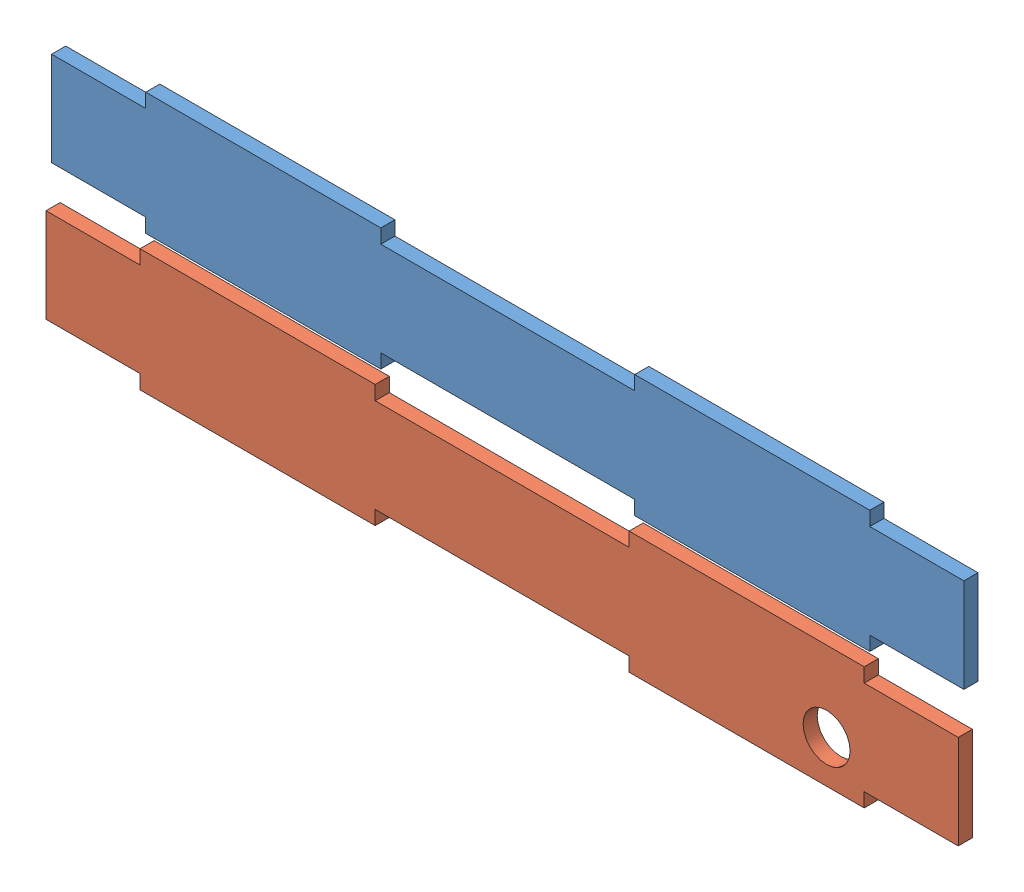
SolidWorks assembly Assem3.sldasm, configuration Default (file format 9000). Lengths in mm.
Overall size (195.2 55.43 3).
2 component instances, 2 part files, 1 mates.
Components (placement in the parent):
- dispenser_stand.p4-1: dispenser_stand.p4.SLDPRT [Default] at (-108.1732 -1.9194 194) size (194 26 3)
- dispenser_stand.p5-1: dispenser_stand.p5.SLDPRT [Default] at (-109.3703 -31.3488 194) size (194 26 3)
Mates (geometry in assembly coordinates):
- Coincident1: coincident aligned: plane of dispenser_stand.p4-1 through (-108.1732 -1.9194 197) normal (0 0 1); plane of dispenser_stand.p5-1 through (-109.3703 -31.3488 197) normal (0 0 1)
